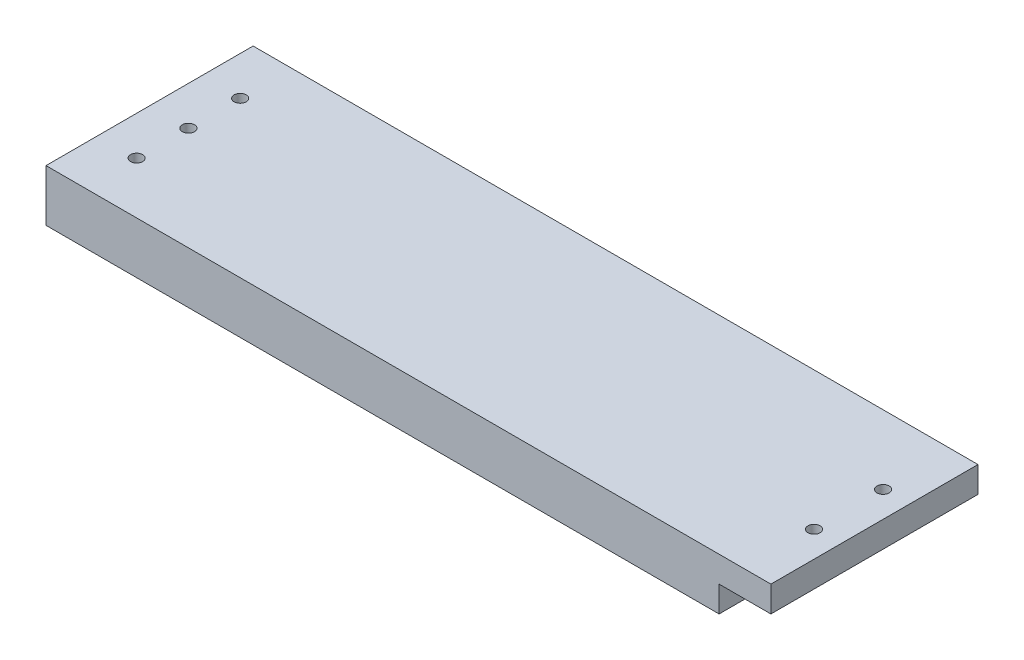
ISO-10303-21;
HEADER;
FILE_DESCRIPTION(('STEP AP214'),'2;1');
FILE_NAME('part.step','',(''),(''),'','','');
FILE_SCHEMA(('AUTOMOTIVE_DESIGN { 1 0 10303 214 1 1 1 1 }'));
ENDSEC;
DATA;
#1=APPLICATION_CONTEXT('core data for automotive mechanical design processes');
#2=APPLICATION_PROTOCOL_DEFINITION('international standard','automotive_design',2000,#1);
#3=PRODUCT_CONTEXT('',#1,'mechanical');
#4=PRODUCT('Part','Part','',(#3));
#5=PRODUCT_RELATED_PRODUCT_CATEGORY('part','',(#4));
#6=PRODUCT_DEFINITION_FORMATION('','',#4);
#7=PRODUCT_DEFINITION_CONTEXT('part definition',#1,'design');
#8=PRODUCT_DEFINITION('design','',#6,#7);
#9=PRODUCT_DEFINITION_SHAPE('','',#8);
#10=(LENGTH_UNIT() NAMED_UNIT(*) SI_UNIT(.MILLI.,.METRE.));
#11=(NAMED_UNIT(*) PLANE_ANGLE_UNIT() SI_UNIT($,.RADIAN.));
#12=(NAMED_UNIT(*) SI_UNIT($,.STERADIAN.) SOLID_ANGLE_UNIT());
#13=UNCERTAINTY_MEASURE_WITH_UNIT(LENGTH_MEASURE(1.E-05),#10,'distance_accuracy_value','');
#14=(GEOMETRIC_REPRESENTATION_CONTEXT(3) GLOBAL_UNCERTAINTY_ASSIGNED_CONTEXT((#13)) GLOBAL_UNIT_ASSIGNED_CONTEXT((#10,
#11,#12)) REPRESENTATION_CONTEXT('',''));
#15=CARTESIAN_POINT('',(0.,0.,0.));
#16=DIRECTION('',(0.,0.,1.));
#17=DIRECTION('',(1.,0.,0.));
#18=AXIS2_PLACEMENT_3D('',#15,#16,#17);
#19=CARTESIAN_POINT('',(165.1,12.7,0.));
#20=DIRECTION('',(-1.,0.,0.));
#21=DIRECTION('',(0.,0.,1.));
#22=AXIS2_PLACEMENT_3D('',#19,#20,#21);
#23=PLANE('',#22);
#24=DIRECTION('',(0.,0.,-1.));
#25=VECTOR('',#24,1.);
#26=CARTESIAN_POINT('',(165.1,6.35,50.8));
#27=LINE('',#26,#25);
#28=CARTESIAN_POINT('',(165.1,6.35,50.8));
#29=VERTEX_POINT('',#28);
#30=CARTESIAN_POINT('',(165.1,6.35,0.));
#31=VERTEX_POINT('',#30);
#32=EDGE_CURVE('E61',#29,#31,#27,.T.);
#33=ORIENTED_EDGE('',*,*,#32,.F.);
#34=DIRECTION('',(0.,-1.,0.));
#35=VECTOR('',#34,1.);
#36=CARTESIAN_POINT('',(165.1,12.7,50.8));
#37=LINE('',#36,#35);
#38=CARTESIAN_POINT('',(165.1,0.,50.8));
#39=VERTEX_POINT('',#38);
#40=EDGE_CURVE('E54',#29,#39,#37,.T.);
#41=ORIENTED_EDGE('',*,*,#40,.T.);
#42=DIRECTION('',(0.,0.,-1.));
#43=VECTOR('',#42,1.);
#44=CARTESIAN_POINT('',(165.1,0.,0.));
#45=LINE('',#44,#43);
#46=CARTESIAN_POINT('',(165.1,0.,0.));
#47=VERTEX_POINT('',#46);
#48=EDGE_CURVE('E101',#39,#47,#45,.T.);
#49=ORIENTED_EDGE('',*,*,#48,.T.);
#50=DIRECTION('',(0.,-1.,0.));
#51=VECTOR('',#50,1.);
#52=CARTESIAN_POINT('',(165.1,12.7,0.));
#53=LINE('',#52,#51);
#54=EDGE_CURVE('E94',#31,#47,#53,.T.);
#55=ORIENTED_EDGE('',*,*,#54,.F.);
#56=EDGE_LOOP('',(#33,#41,#49,#55));
#57=FACE_BOUND('',#56,.T.);
#58=ADVANCED_FACE('F45',(#57),#23,.F.);
#59=CARTESIAN_POINT('',(0.,12.7,0.));
#60=DIRECTION('',(1.,0.,0.));
#61=DIRECTION('',(0.,0.,-1.));
#62=AXIS2_PLACEMENT_3D('',#59,#60,#61);
#63=PLANE('',#62);
#64=DIRECTION('',(0.,0.,1.));
#65=VECTOR('',#64,1.);
#66=CARTESIAN_POINT('',(0.,0.,0.));
#67=LINE('',#66,#65);
#68=CARTESIAN_POINT('',(0.,0.,0.));
#69=VERTEX_POINT('',#68);
#70=CARTESIAN_POINT('',(0.,0.,50.8));
#71=VERTEX_POINT('',#70);
#72=EDGE_CURVE('E106',#69,#71,#67,.T.);
#73=ORIENTED_EDGE('',*,*,#72,.T.);
#74=DIRECTION('',(0.,-1.,0.));
#75=VECTOR('',#74,1.);
#76=CARTESIAN_POINT('',(0.,12.7,50.8));
#77=LINE('',#76,#75);
#78=CARTESIAN_POINT('',(0.,12.7,50.8));
#79=VERTEX_POINT('',#78);
#80=EDGE_CURVE('E11',#79,#71,#77,.T.);
#81=ORIENTED_EDGE('',*,*,#80,.F.);
#82=DIRECTION('',(0.,0.,1.));
#83=VECTOR('',#82,1.);
#84=CARTESIAN_POINT('',(0.,12.7,0.));
#85=LINE('',#84,#83);
#86=CARTESIAN_POINT('',(0.,12.7,0.));
#87=VERTEX_POINT('',#86);
#88=EDGE_CURVE('E100',#87,#79,#85,.T.);
#89=ORIENTED_EDGE('',*,*,#88,.F.);
#90=DIRECTION('',(0.,-1.,0.));
#91=VECTOR('',#90,1.);
#92=CARTESIAN_POINT('',(0.,12.7,0.));
#93=LINE('',#92,#91);
#94=EDGE_CURVE('E91',#87,#69,#93,.T.);
#95=ORIENTED_EDGE('',*,*,#94,.T.);
#96=EDGE_LOOP('',(#73,#81,#89,#95));
#97=FACE_BOUND('',#96,.T.);
#98=ADVANCED_FACE('F47',(#97),#63,.F.);
#99=CARTESIAN_POINT('',(0.,12.7,50.8));
#100=DIRECTION('',(0.,0.,-1.));
#101=DIRECTION('',(-1.,0.,0.));
#102=AXIS2_PLACEMENT_3D('',#99,#100,#101);
#103=PLANE('',#102);
#104=DIRECTION('',(1.,0.,0.));
#105=VECTOR('',#104,1.);
#106=CARTESIAN_POINT('',(0.,0.,50.8));
#107=LINE('',#106,#105);
#108=EDGE_CURVE('E111',#71,#39,#107,.T.);
#109=ORIENTED_EDGE('',*,*,#108,.T.);
#110=ORIENTED_EDGE('',*,*,#40,.F.);
#111=DIRECTION('',(-1.,0.,0.));
#112=VECTOR('',#111,1.);
#113=CARTESIAN_POINT('',(177.8,6.35,50.8));
#114=LINE('',#113,#112);
#115=CARTESIAN_POINT('',(177.8,6.35,50.8));
#116=VERTEX_POINT('',#115);
#117=EDGE_CURVE('E148',#116,#29,#114,.T.);
#118=ORIENTED_EDGE('',*,*,#117,.F.);
#119=DIRECTION('',(0.,-1.,0.));
#120=VECTOR('',#119,1.);
#121=CARTESIAN_POINT('',(177.8,12.7,50.8));
#122=LINE('',#121,#120);
#123=CARTESIAN_POINT('',(177.8,12.7,50.8));
#124=VERTEX_POINT('',#123);
#125=EDGE_CURVE('E136',#124,#116,#122,.T.);
#126=ORIENTED_EDGE('',*,*,#125,.F.);
#127=DIRECTION('',(1.,0.,0.));
#128=VECTOR('',#127,1.);
#129=CARTESIAN_POINT('',(0.,12.7,50.8));
#130=LINE('',#129,#128);
#131=EDGE_CURVE('E134',#79,#124,#130,.T.);
#132=ORIENTED_EDGE('',*,*,#131,.F.);
#133=ORIENTED_EDGE('',*,*,#80,.T.);
#134=EDGE_LOOP('',(#109,#110,#118,#126,#132,#133));
#135=FACE_BOUND('',#134,.T.);
#136=ADVANCED_FACE('F131',(#135),#103,.F.);
#137=CARTESIAN_POINT('',(0.,12.7,0.));
#138=DIRECTION('',(0.,0.,1.));
#139=DIRECTION('',(1.,0.,0.));
#140=AXIS2_PLACEMENT_3D('',#137,#138,#139);
#141=PLANE('',#140);
#142=DIRECTION('',(-1.,0.,0.));
#143=VECTOR('',#142,1.);
#144=CARTESIAN_POINT('',(0.,0.,0.));
#145=LINE('',#144,#143);
#146=EDGE_CURVE('E88',#47,#69,#145,.T.);
#147=ORIENTED_EDGE('',*,*,#146,.T.);
#148=ORIENTED_EDGE('',*,*,#94,.F.);
#149=DIRECTION('',(-1.,0.,0.));
#150=VECTOR('',#149,1.);
#151=CARTESIAN_POINT('',(0.,12.7,0.));
#152=LINE('',#151,#150);
#153=CARTESIAN_POINT('',(177.8,12.7,0.));
#154=VERTEX_POINT('',#153);
#155=EDGE_CURVE('E70',#154,#87,#152,.T.);
#156=ORIENTED_EDGE('',*,*,#155,.F.);
#157=DIRECTION('',(0.,1.,0.));
#158=VECTOR('',#157,1.);
#159=CARTESIAN_POINT('',(177.8,12.7,0.));
#160=LINE('',#159,#158);
#161=CARTESIAN_POINT('',(177.8,6.35,0.));
#162=VERTEX_POINT('',#161);
#163=EDGE_CURVE('E174',#162,#154,#160,.T.);
#164=ORIENTED_EDGE('',*,*,#163,.F.);
#165=DIRECTION('',(-1.,0.,0.));
#166=VECTOR('',#165,1.);
#167=CARTESIAN_POINT('',(177.8,6.35,0.));
#168=LINE('',#167,#166);
#169=EDGE_CURVE('E165',#162,#31,#168,.T.);
#170=ORIENTED_EDGE('',*,*,#169,.T.);
#171=ORIENTED_EDGE('',*,*,#54,.T.);
#172=EDGE_LOOP('',(#147,#148,#156,#164,#170,#171));
#173=FACE_BOUND('',#172,.T.);
#174=ADVANCED_FACE('F90',(#173),#141,.F.);
#175=CARTESIAN_POINT('',(0.,12.7,0.));
#176=DIRECTION('',(0.,1.,0.));
#177=DIRECTION('',(0.,0.,1.));
#178=AXIS2_PLACEMENT_3D('',#175,#176,#177);
#179=PLANE('',#178);
#180=CARTESIAN_POINT('',(171.45,12.7,33.8666666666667));
#181=DIRECTION('',(0.,-1.,0.));
#182=DIRECTION('',(0.,0.,-1.));
#183=AXIS2_PLACEMENT_3D('',#180,#181,#182);
#184=CIRCLE('',#183,1.48999999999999);
#185=CARTESIAN_POINT('',(171.45,12.7,32.3766666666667));
#186=VERTEX_POINT('',#185);
#187=EDGE_CURVE('E171',#186,#186,#184,.T.);
#188=ORIENTED_EDGE('',*,*,#187,.T.);
#189=EDGE_LOOP('',(#188));
#190=FACE_BOUND('',#189,.T.);
#191=CARTESIAN_POINT('',(171.45,12.7,16.9333333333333));
#192=DIRECTION('',(0.,-1.,0.));
#193=DIRECTION('',(0.,0.,-1.));
#194=AXIS2_PLACEMENT_3D('',#191,#192,#193);
#195=CIRCLE('',#194,1.48999999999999);
#196=CARTESIAN_POINT('',(171.45,12.7,15.4433333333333));
#197=VERTEX_POINT('',#196);
#198=EDGE_CURVE('E184',#197,#197,#195,.T.);
#199=ORIENTED_EDGE('',*,*,#198,.T.);
#200=EDGE_LOOP('',(#199));
#201=FACE_BOUND('',#200,.T.);
#202=CARTESIAN_POINT('',(9.525,12.7,12.7));
#203=DIRECTION('',(0.,1.,0.));
#204=DIRECTION('',(0.,0.,1.));
#205=AXIS2_PLACEMENT_3D('',#202,#203,#204);
#206=CIRCLE('',#205,1.49);
#207=CARTESIAN_POINT('',(9.525,12.7,14.19));
#208=VERTEX_POINT('',#207);
#209=EDGE_CURVE('E119',#208,#208,#206,.T.);
#210=ORIENTED_EDGE('',*,*,#209,.F.);
#211=EDGE_LOOP('',(#210));
#212=FACE_BOUND('',#211,.T.);
#213=CARTESIAN_POINT('',(9.525,12.7,25.4));
#214=DIRECTION('',(0.,1.,0.));
#215=DIRECTION('',(0.,0.,1.));
#216=AXIS2_PLACEMENT_3D('',#213,#214,#215);
#217=CIRCLE('',#216,1.49);
#218=CARTESIAN_POINT('',(9.525,12.7,26.89));
#219=VERTEX_POINT('',#218);
#220=EDGE_CURVE('E156',#219,#219,#217,.T.);
#221=ORIENTED_EDGE('',*,*,#220,.F.);
#222=EDGE_LOOP('',(#221));
#223=FACE_BOUND('',#222,.T.);
#224=CARTESIAN_POINT('',(9.525,12.7,38.1));
#225=DIRECTION('',(0.,1.,0.));
#226=DIRECTION('',(0.,0.,1.));
#227=AXIS2_PLACEMENT_3D('',#224,#225,#226);
#228=CIRCLE('',#227,1.49);
#229=CARTESIAN_POINT('',(9.525,12.7,39.59));
#230=VERTEX_POINT('',#229);
#231=EDGE_CURVE('E147',#230,#230,#228,.T.);
#232=ORIENTED_EDGE('',*,*,#231,.F.);
#233=EDGE_LOOP('',(#232));
#234=FACE_BOUND('',#233,.T.);
#235=ORIENTED_EDGE('',*,*,#88,.T.);
#236=ORIENTED_EDGE('',*,*,#131,.T.);
#237=DIRECTION('',(0.,0.,1.));
#238=VECTOR('',#237,1.);
#239=CARTESIAN_POINT('',(177.8,12.7,50.8));
#240=LINE('',#239,#238);
#241=EDGE_CURVE('E168',#154,#124,#240,.T.);
#242=ORIENTED_EDGE('',*,*,#241,.F.);
#243=ORIENTED_EDGE('',*,*,#155,.T.);
#244=EDGE_LOOP('',(#235,#236,#242,#243));
#245=FACE_BOUND('',#244,.T.);
#246=ADVANCED_FACE('F139',(#190,#201,#212,#223,#234,#245),#179,.T.);
#247=CARTESIAN_POINT('',(0.,0.,0.));
#248=DIRECTION('',(0.,1.,0.));
#249=DIRECTION('',(0.,0.,1.));
#250=AXIS2_PLACEMENT_3D('',#247,#248,#249);
#251=PLANE('',#250);
#252=CARTESIAN_POINT('',(9.525,0.,12.7));
#253=DIRECTION('',(0.,1.,0.));
#254=DIRECTION('',(0.,0.,1.));
#255=AXIS2_PLACEMENT_3D('',#252,#253,#254);
#256=CIRCLE('',#255,1.49);
#257=CARTESIAN_POINT('',(9.525,0.,14.19));
#258=VERTEX_POINT('',#257);
#259=EDGE_CURVE('E113',#258,#258,#256,.T.);
#260=ORIENTED_EDGE('',*,*,#259,.T.);
#261=EDGE_LOOP('',(#260));
#262=FACE_BOUND('',#261,.T.);
#263=CARTESIAN_POINT('',(9.525,0.,25.4));
#264=DIRECTION('',(0.,1.,0.));
#265=DIRECTION('',(0.,0.,1.));
#266=AXIS2_PLACEMENT_3D('',#263,#264,#265);
#267=CIRCLE('',#266,1.49);
#268=CARTESIAN_POINT('',(9.525,0.,26.89));
#269=VERTEX_POINT('',#268);
#270=EDGE_CURVE('E152',#269,#269,#267,.T.);
#271=ORIENTED_EDGE('',*,*,#270,.T.);
#272=EDGE_LOOP('',(#271));
#273=FACE_BOUND('',#272,.T.);
#274=CARTESIAN_POINT('',(9.525,0.,38.1));
#275=DIRECTION('',(0.,1.,0.));
#276=DIRECTION('',(0.,0.,1.));
#277=AXIS2_PLACEMENT_3D('',#274,#275,#276);
#278=CIRCLE('',#277,1.49);
#279=CARTESIAN_POINT('',(9.525,0.,39.59));
#280=VERTEX_POINT('',#279);
#281=EDGE_CURVE('E143',#280,#280,#278,.T.);
#282=ORIENTED_EDGE('',*,*,#281,.T.);
#283=EDGE_LOOP('',(#282));
#284=FACE_BOUND('',#283,.T.);
#285=ORIENTED_EDGE('',*,*,#72,.F.);
#286=ORIENTED_EDGE('',*,*,#146,.F.);
#287=ORIENTED_EDGE('',*,*,#48,.F.);
#288=ORIENTED_EDGE('',*,*,#108,.F.);
#289=EDGE_LOOP('',(#285,#286,#287,#288));
#290=FACE_BOUND('',#289,.T.);
#291=ADVANCED_FACE('F109',(#262,#273,#284,#290),#251,.F.);
#292=CARTESIAN_POINT('',(9.525,0.,38.1));
#293=DIRECTION('',(0.,1.,0.));
#294=DIRECTION('',(0.,0.,1.));
#295=AXIS2_PLACEMENT_3D('',#292,#293,#294);
#296=CYLINDRICAL_SURFACE('',#295,1.49);
#297=ORIENTED_EDGE('',*,*,#281,.F.);
#298=EDGE_LOOP('',(#297));
#299=FACE_BOUND('',#298,.T.);
#300=ORIENTED_EDGE('',*,*,#231,.T.);
#301=EDGE_LOOP('',(#300));
#302=FACE_BOUND('',#301,.T.);
#303=ADVANCED_FACE('F255',(#299,#302),#296,.F.);
#304=CARTESIAN_POINT('',(9.525,0.,25.4));
#305=DIRECTION('',(0.,1.,0.));
#306=DIRECTION('',(0.,0.,1.));
#307=AXIS2_PLACEMENT_3D('',#304,#305,#306);
#308=CYLINDRICAL_SURFACE('',#307,1.49);
#309=ORIENTED_EDGE('',*,*,#270,.F.);
#310=EDGE_LOOP('',(#309));
#311=FACE_BOUND('',#310,.T.);
#312=ORIENTED_EDGE('',*,*,#220,.T.);
#313=EDGE_LOOP('',(#312));
#314=FACE_BOUND('',#313,.T.);
#315=ADVANCED_FACE('F260',(#311,#314),#308,.F.);
#316=CARTESIAN_POINT('',(9.525,0.,12.7));
#317=DIRECTION('',(0.,1.,0.));
#318=DIRECTION('',(0.,0.,1.));
#319=AXIS2_PLACEMENT_3D('',#316,#317,#318);
#320=CYLINDRICAL_SURFACE('',#319,1.49);
#321=ORIENTED_EDGE('',*,*,#259,.F.);
#322=EDGE_LOOP('',(#321));
#323=FACE_BOUND('',#322,.T.);
#324=ORIENTED_EDGE('',*,*,#209,.T.);
#325=EDGE_LOOP('',(#324));
#326=FACE_BOUND('',#325,.T.);
#327=ADVANCED_FACE('F213',(#323,#326),#320,.F.);
#328=CARTESIAN_POINT('',(177.8,6.35,50.8));
#329=DIRECTION('',(0.,1.,0.));
#330=DIRECTION('',(0.,0.,1.));
#331=AXIS2_PLACEMENT_3D('',#328,#329,#330);
#332=PLANE('',#331);
#333=CARTESIAN_POINT('',(171.45,6.35,33.8666666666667));
#334=DIRECTION('',(0.,-1.,0.));
#335=DIRECTION('',(0.,0.,-1.));
#336=AXIS2_PLACEMENT_3D('',#333,#334,#335);
#337=CIRCLE('',#336,1.48999999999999);
#338=CARTESIAN_POINT('',(171.45,6.35,32.3766666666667));
#339=VERTEX_POINT('',#338);
#340=EDGE_CURVE('E192',#339,#339,#337,.T.);
#341=ORIENTED_EDGE('',*,*,#340,.F.);
#342=EDGE_LOOP('',(#341));
#343=FACE_BOUND('',#342,.T.);
#344=CARTESIAN_POINT('',(171.45,6.35,16.9333333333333));
#345=DIRECTION('',(0.,-1.,0.));
#346=DIRECTION('',(0.,0.,-1.));
#347=AXIS2_PLACEMENT_3D('',#344,#345,#346);
#348=CIRCLE('',#347,1.48999999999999);
#349=CARTESIAN_POINT('',(171.45,6.35,15.4433333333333));
#350=VERTEX_POINT('',#349);
#351=EDGE_CURVE('E188',#350,#350,#348,.T.);
#352=ORIENTED_EDGE('',*,*,#351,.F.);
#353=EDGE_LOOP('',(#352));
#354=FACE_BOUND('',#353,.T.);
#355=ORIENTED_EDGE('',*,*,#32,.T.);
#356=ORIENTED_EDGE('',*,*,#169,.F.);
#357=DIRECTION('',(0.,0.,-1.));
#358=VECTOR('',#357,1.);
#359=CARTESIAN_POINT('',(177.8,6.35,50.8));
#360=LINE('',#359,#358);
#361=EDGE_CURVE('E178',#116,#162,#360,.T.);
#362=ORIENTED_EDGE('',*,*,#361,.F.);
#363=ORIENTED_EDGE('',*,*,#117,.T.);
#364=EDGE_LOOP('',(#355,#356,#362,#363));
#365=FACE_BOUND('',#364,.T.);
#366=ADVANCED_FACE('F209',(#343,#354,#365),#332,.F.);
#367=CARTESIAN_POINT('',(177.8,0.,0.));
#368=DIRECTION('',(1.,0.,0.));
#369=DIRECTION('',(0.,0.,-1.));
#370=AXIS2_PLACEMENT_3D('',#367,#368,#369);
#371=PLANE('',#370);
#372=ORIENTED_EDGE('',*,*,#125,.T.);
#373=ORIENTED_EDGE('',*,*,#361,.T.);
#374=ORIENTED_EDGE('',*,*,#163,.T.);
#375=ORIENTED_EDGE('',*,*,#241,.T.);
#376=EDGE_LOOP('',(#372,#373,#374,#375));
#377=FACE_BOUND('',#376,.T.);
#378=ADVANCED_FACE('F212',(#377),#371,.T.);
#379=CARTESIAN_POINT('',(171.45,12.7,16.9333333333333));
#380=DIRECTION('',(0.,-1.,0.));
#381=DIRECTION('',(0.,0.,-1.));
#382=AXIS2_PLACEMENT_3D('',#379,#380,#381);
#383=CYLINDRICAL_SURFACE('',#382,1.48999999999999);
#384=ORIENTED_EDGE('',*,*,#198,.F.);
#385=EDGE_LOOP('',(#384));
#386=FACE_BOUND('',#385,.T.);
#387=ORIENTED_EDGE('',*,*,#351,.T.);
#388=EDGE_LOOP('',(#387));
#389=FACE_BOUND('',#388,.T.);
#390=ADVANCED_FACE('F205',(#386,#389),#383,.F.);
#391=CARTESIAN_POINT('',(171.45,12.7,33.8666666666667));
#392=DIRECTION('',(0.,-1.,0.));
#393=DIRECTION('',(0.,0.,-1.));
#394=AXIS2_PLACEMENT_3D('',#391,#392,#393);
#395=CYLINDRICAL_SURFACE('',#394,1.48999999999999);
#396=ORIENTED_EDGE('',*,*,#187,.F.);
#397=EDGE_LOOP('',(#396));
#398=FACE_BOUND('',#397,.T.);
#399=ORIENTED_EDGE('',*,*,#340,.T.);
#400=EDGE_LOOP('',(#399));
#401=FACE_BOUND('',#400,.T.);
#402=ADVANCED_FACE('F202',(#398,#401),#395,.F.);
#403=CLOSED_SHELL('',(#58,#98,#136,#174,#246,#291,#303,#315,#327,#366,#378,#390,#402));
#404=MANIFOLD_SOLID_BREP('B2',#403);
#405=ADVANCED_BREP_SHAPE_REPRESENTATION('',(#18,#404),#14);
#406=SHAPE_DEFINITION_REPRESENTATION(#9,#405);
ENDSEC;
END-ISO-10303-21;
